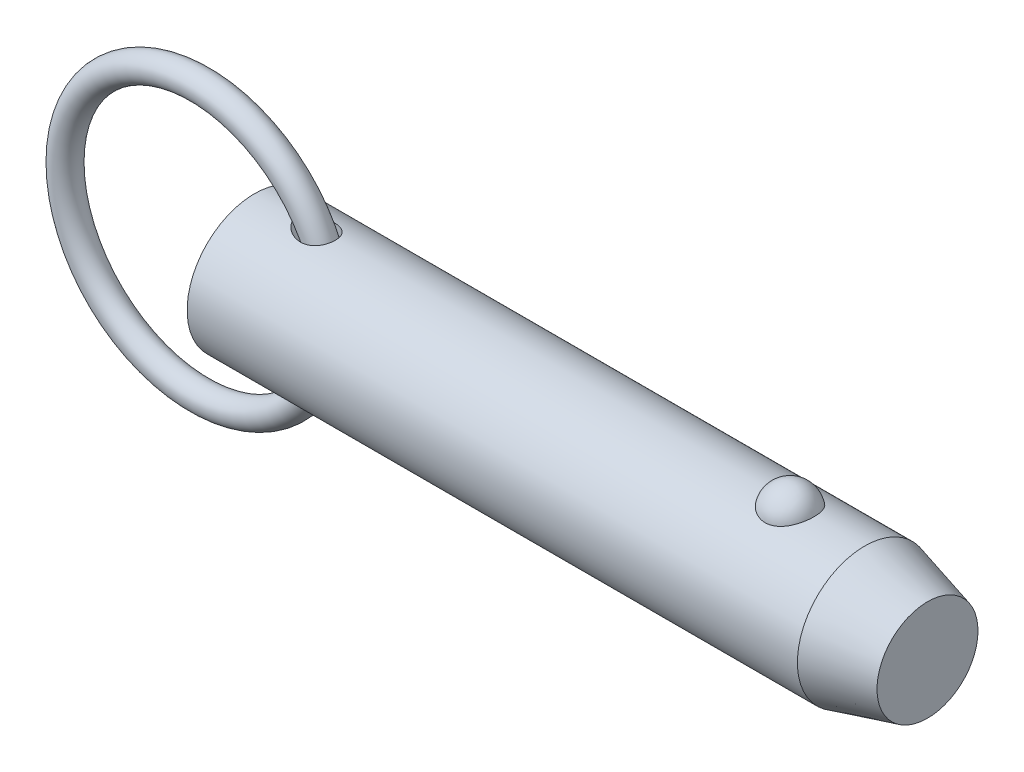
ISO-10303-21;
HEADER;
FILE_DESCRIPTION(('STEP AP214'),'2;1');
FILE_NAME('part.step','',(''),(''),'','','');
FILE_SCHEMA(('AUTOMOTIVE_DESIGN { 1 0 10303 214 1 1 1 1 }'));
ENDSEC;
DATA;
#1=APPLICATION_CONTEXT('core data for automotive mechanical design processes');
#2=APPLICATION_PROTOCOL_DEFINITION('international standard','automotive_design',2000,#1);
#3=PRODUCT_CONTEXT('',#1,'mechanical');
#4=PRODUCT('Part','Part','',(#3));
#5=PRODUCT_RELATED_PRODUCT_CATEGORY('part','',(#4));
#6=PRODUCT_DEFINITION_FORMATION('','',#4);
#7=PRODUCT_DEFINITION_CONTEXT('part definition',#1,'design');
#8=PRODUCT_DEFINITION('design','',#6,#7);
#9=PRODUCT_DEFINITION_SHAPE('','',#8);
#10=(LENGTH_UNIT() NAMED_UNIT(*) SI_UNIT(.MILLI.,.METRE.));
#11=(NAMED_UNIT(*) PLANE_ANGLE_UNIT() SI_UNIT($,.RADIAN.));
#12=(NAMED_UNIT(*) SI_UNIT($,.STERADIAN.) SOLID_ANGLE_UNIT());
#13=UNCERTAINTY_MEASURE_WITH_UNIT(LENGTH_MEASURE(1.E-05),#10,'distance_accuracy_value','');
#14=(GEOMETRIC_REPRESENTATION_CONTEXT(3) GLOBAL_UNCERTAINTY_ASSIGNED_CONTEXT((#13)) GLOBAL_UNIT_ASSIGNED_CONTEXT((#10,
#11,#12)) REPRESENTATION_CONTEXT('',''));
#15=CARTESIAN_POINT('',(0.,0.,0.));
#16=DIRECTION('',(0.,0.,1.));
#17=DIRECTION('',(1.,0.,0.));
#18=AXIS2_PLACEMENT_3D('',#15,#16,#17);
#19=CARTESIAN_POINT('',(-6.46799987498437,0.,0.));
#20=DIRECTION('',(0.,0.,1.));
#21=DIRECTION('',(1.,0.,0.));
#22=AXIS2_PLACEMENT_3D('',#19,#20,#21);
#23=TOROIDAL_SURFACE('',#22,15.875,1.588);
#24=CARTESIAN_POINT('',(10.9950001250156,0.,0.));
#25=VERTEX_POINT('',#24);
#26=VERTEX_LOOP('',#25);
#27=FACE_BOUND('',#26,.T.);
#28=ADVANCED_FACE('P0_F12',(#27),#23,.T.);
#29=CLOSED_SHELL('',(#28));
#30=MANIFOLD_SOLID_BREP('P0_B1',#29);
#31=CARTESIAN_POINT('',(0.,0.,0.));
#32=DIRECTION('',(1.,0.,0.));
#33=DIRECTION('',(0.,0.,-1.));
#34=AXIS2_PLACEMENT_3D('',#31,#32,#33);
#35=CYLINDRICAL_SURFACE('',#34,7.94);
#36=CARTESIAN_POINT('',(4.99454278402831,7.92831028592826,-0.430692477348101));
#37=CARTESIAN_POINT('',(5.02621962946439,7.92271974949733,-0.533554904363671));
#38=CARTESIAN_POINT('',(5.06869972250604,7.91528872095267,-0.633052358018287));
#39=CARTESIAN_POINT('',(5.17094751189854,7.89785690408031,-0.822566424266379));
#40=CARTESIAN_POINT('',(5.23077290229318,7.88784755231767,-0.912550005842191));
#41=CARTESIAN_POINT('',(5.37866013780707,7.8639674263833,-1.10117829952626));
#42=CARTESIAN_POINT('',(5.47004908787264,7.84973599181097,-1.19714712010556));
#43=CARTESIAN_POINT('',(5.66695490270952,7.82090787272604,-1.37293476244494));
#44=CARTESIAN_POINT('',(5.77247743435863,7.80631104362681,-1.45274707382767));
#45=CARTESIAN_POINT('',(5.99604254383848,7.77793596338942,-1.59776875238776));
#46=CARTESIAN_POINT('',(6.11428384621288,7.76417836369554,-1.66267404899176));
#47=CARTESIAN_POINT('',(6.35882685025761,7.73912410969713,-1.77564129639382));
#48=CARTESIAN_POINT('',(6.48513256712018,7.72782869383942,-1.82369477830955));
#49=CARTESIAN_POINT('',(6.76898453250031,7.70705630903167,-1.90977520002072));
#50=CARTESIAN_POINT('',(6.92778004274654,7.69837706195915,-1.94395681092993));
#51=CARTESIAN_POINT('',(7.24915504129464,7.6881294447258,-1.98412381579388));
#52=CARTESIAN_POINT('',(7.41173039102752,7.68655363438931,-1.99013871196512));
#53=CARTESIAN_POINT('',(7.697714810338,7.69094561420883,-1.97306069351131));
#54=CARTESIAN_POINT('',(7.82153338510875,7.69526202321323,-1.95634328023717));
#55=CARTESIAN_POINT('',(8.06460511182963,7.70859273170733,-1.90314615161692));
#56=CARTESIAN_POINT('',(8.18386164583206,7.7176034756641,-1.86668139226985));
#57=CARTESIAN_POINT('',(8.41450663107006,7.73959050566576,-1.77331230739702));
#58=CARTESIAN_POINT('',(8.52585042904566,7.75258738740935,-1.71630154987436));
#59=CARTESIAN_POINT('',(8.73575290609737,7.7809705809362,-1.58263416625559));
#60=CARTESIAN_POINT('',(8.8343144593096,7.7963563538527,-1.50598196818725));
#61=CARTESIAN_POINT('',(9.00639839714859,7.8259635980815,-1.34315626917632));
#62=CARTESIAN_POINT('',(9.08139772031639,7.84016008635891,-1.25853389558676));
#63=CARTESIAN_POINT('',(9.21545590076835,7.86710959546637,-1.07729126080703));
#64=CARTESIAN_POINT('',(9.27451869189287,7.87986297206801,-0.980673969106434));
#65=CARTESIAN_POINT('',(9.37315031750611,7.90198817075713,-0.782161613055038));
#66=CARTESIAN_POINT('',(9.41336512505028,7.91146854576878,-0.68059867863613));
#67=CARTESIAN_POINT('',(9.47650914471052,7.92664976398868,-0.471967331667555));
#68=CARTESIAN_POINT('',(9.49943917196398,7.93235078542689,-0.364899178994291));
#69=CARTESIAN_POINT('',(9.52744661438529,7.93934369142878,-0.14863226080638));
#70=CARTESIAN_POINT('',(9.53257574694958,7.9406483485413,-0.0394405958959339));
#71=CARTESIAN_POINT('',(9.52501411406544,7.93874464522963,0.178286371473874));
#72=CARTESIAN_POINT('',(9.51232314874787,7.93553623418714,0.286821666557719));
#73=CARTESIAN_POINT('',(9.46937875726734,7.92494527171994,0.500278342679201));
#74=CARTESIAN_POINT('',(9.43910562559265,7.9175580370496,0.605195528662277));
#75=CARTESIAN_POINT('',(9.36168926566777,7.8994090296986,0.808294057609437));
#76=CARTESIAN_POINT('',(9.31454677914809,7.88864740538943,0.906475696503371));
#77=CARTESIAN_POINT('',(9.20464679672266,7.86494645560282,1.09319438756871));
#78=CARTESIAN_POINT('',(9.14191093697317,7.85201015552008,1.18174456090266));
#79=CARTESIAN_POINT('',(9.00249124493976,7.82536913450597,1.34692675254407));
#80=CARTESIAN_POINT('',(8.92580850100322,7.81166447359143,1.42355969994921));
#81=CARTESIAN_POINT('',(8.76033130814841,7.78490157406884,1.56333296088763));
#82=CARTESIAN_POINT('',(8.67148512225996,7.77184644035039,1.62641250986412));
#83=CARTESIAN_POINT('',(8.48457694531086,7.74778101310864,1.73744892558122));
#84=CARTESIAN_POINT('',(8.3865141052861,7.73677090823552,1.78540439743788));
#85=CARTESIAN_POINT('',(8.18013312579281,7.71742695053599,1.86728938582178));
#86=CARTESIAN_POINT('',(8.07156725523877,7.7092102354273,1.90061897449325));
#87=CARTESIAN_POINT('',(7.85050876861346,7.6966502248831,1.95085652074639));
#88=CARTESIAN_POINT('',(7.73801453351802,7.69230854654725,1.967757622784));
#89=CARTESIAN_POINT('',(7.50002163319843,7.6873799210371,1.98693391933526));
#90=CARTESIAN_POINT('',(7.37438052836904,7.68722739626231,1.98751701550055));
#91=CARTESIAN_POINT('',(7.12435864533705,7.69142268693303,1.97121025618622));
#92=CARTESIAN_POINT('',(6.99997834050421,7.6957721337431,1.9543140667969));
#93=CARTESIAN_POINT('',(6.73521978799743,7.70925573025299,1.90049277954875));
#94=CARTESIAN_POINT('',(6.59543541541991,7.71903968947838,1.86081454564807));
#95=CARTESIAN_POINT('',(6.32319848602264,7.74233460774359,1.76138158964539));
#96=CARTESIAN_POINT('',(6.19076082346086,7.75585282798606,1.7015877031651));
#97=CARTESIAN_POINT('',(5.99269110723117,7.7785835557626,1.59336057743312));
#98=CARTESIAN_POINT('',(5.92332049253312,7.78707101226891,1.55151799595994));
#99=CARTESIAN_POINT('',(5.78862576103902,7.80440479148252,1.46183267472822));
#100=CARTESIAN_POINT('',(5.72330291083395,7.81325122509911,1.41398807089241));
#101=CARTESIAN_POINT('',(5.53492618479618,7.83980388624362,1.26162857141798));
#102=CARTESIAN_POINT('',(5.41884115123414,7.85759887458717,1.14795556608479));
#103=CARTESIAN_POINT('',(5.25731156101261,7.88350844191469,0.948390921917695));
#104=CARTESIAN_POINT('',(5.20241173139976,7.89260196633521,0.87019982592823));
#105=CARTESIAN_POINT('',(5.10541071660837,7.90897737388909,0.70602680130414));
#106=CARTESIAN_POINT('',(5.06329682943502,7.91626105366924,0.620052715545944));
#107=CARTESIAN_POINT('',(4.99458837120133,7.92827352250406,0.440665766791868));
#108=CARTESIAN_POINT('',(4.96816655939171,7.93297382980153,0.347182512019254));
#109=CARTESIAN_POINT('',(4.94275291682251,7.93751024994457,0.204498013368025));
#110=CARTESIAN_POINT('',(4.93665149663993,7.9386033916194,0.156529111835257));
#111=CARTESIAN_POINT('',(4.92932198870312,7.93991739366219,0.0602142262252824));
#112=CARTESIAN_POINT('',(4.9280924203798,7.94013851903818,0.011868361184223));
#113=CARTESIAN_POINT('',(4.93104052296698,7.93960920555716,-0.103241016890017));
#114=CARTESIAN_POINT('',(4.93747289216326,7.93845361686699,-0.169956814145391));
#115=CARTESIAN_POINT('',(4.95939910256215,7.93453812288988,-0.301777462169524));
#116=CARTESIAN_POINT('',(4.97489225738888,7.9317783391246,-0.36688243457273));
#117=CARTESIAN_POINT('',(4.99454278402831,7.92831028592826,-0.430692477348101));
#118=B_SPLINE_CURVE_WITH_KNOTS('',3,(#36,#37,#38,#39,#40,#41,#42,#43,#44,#45,#46,#47,#48,#49,
#50,#51,#52,#53,#54,#55,#56,#57,#58,#59,#60,#61,#62,#63,#64,#65,#66,#67,#68,#69,#70,#71,#72,#73,
#74,#75,#76,#77,#78,#79,#80,#81,#82,#83,#84,#85,#86,#87,#88,#89,#90,#91,#92,#93,#94,#95,#96,#97,
#98,#99,#100,#101,#102,#103,#104,#105,#106,#107,#108,#109,#110,#111,#112,#113,#114,#115,#116,
#117),.UNSPECIFIED.,.T.,.F.,(4,2,2,2,2,2,2,2,2,2,2,2,2,2,2,2,2,2,2,2,2,2,2,2,2,2,2,2,2,2,2,2,2,
2,2,2,2,2,2,2,4),(0.,0.323000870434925,0.647088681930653,1.04479679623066,1.4426648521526,
1.84804279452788,2.25362416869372,2.73917777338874,3.2242226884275,3.59772765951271,
3.97095014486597,4.34613445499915,4.72123425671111,5.06140749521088,5.40149668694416,
5.72887751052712,6.05624289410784,6.38265637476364,6.70907351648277,7.03585720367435,
7.36262652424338,7.68894495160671,8.01523792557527,8.34296459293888,8.67072147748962,
9.01089033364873,9.35120108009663,9.72668268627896,10.1023004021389,10.5375309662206,
10.9736138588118,11.2176803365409,11.461822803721,11.9480055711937,12.2349837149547,
12.5216758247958,12.8114683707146,12.9563497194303,13.1011870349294,13.3015737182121,
13.5019452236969),.UNSPECIFIED.);
#119=CARTESIAN_POINT('',(4.99454278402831,7.92831028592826,-0.430692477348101));
#120=VERTEX_POINT('',#119);
#121=EDGE_CURVE('P1_E40',#120,#120,#118,.T.);
#122=ORIENTED_EDGE('',*,*,#121,.T.);
#123=EDGE_LOOP('',(#122));
#124=FACE_BOUND('',#123,.T.);
#125=CARTESIAN_POINT('',(71.9718791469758,0.,0.));
#126=DIRECTION('',(1.,0.,0.));
#127=DIRECTION('',(0.,0.,-1.));
#128=AXIS2_PLACEMENT_3D('',#125,#126,#127);
#129=CIRCLE('',#128,7.94);
#130=CARTESIAN_POINT('',(71.9718791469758,0.,-7.94));
#131=VERTEX_POINT('',#130);
#132=EDGE_CURVE('P1_E25',#131,#131,#129,.T.);
#133=ORIENTED_EDGE('',*,*,#132,.F.);
#134=EDGE_LOOP('',(#133));
#135=FACE_BOUND('',#134,.T.);
#136=CARTESIAN_POINT('',(0.,0.,0.));
#137=DIRECTION('',(1.,0.,0.));
#138=DIRECTION('',(0.,0.,-1.));
#139=AXIS2_PLACEMENT_3D('',#136,#137,#138);
#140=CIRCLE('',#139,7.94);
#141=CARTESIAN_POINT('',(0.,0.,-7.94));
#142=VERTEX_POINT('',#141);
#143=EDGE_CURVE('P1_E9',#142,#142,#140,.T.);
#144=ORIENTED_EDGE('',*,*,#143,.T.);
#145=EDGE_LOOP('',(#144));
#146=FACE_BOUND('',#145,.T.);
#147=CARTESIAN_POINT('',(63.1649074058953,7.37767842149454,2.93486986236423));
#148=CARTESIAN_POINT('',(63.0127496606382,7.3776732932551,2.93487505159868));
#149=CARTESIAN_POINT('',(62.8606329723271,7.38258419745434,2.92262454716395));
#150=CARTESIAN_POINT('',(62.5609284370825,7.40163229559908,2.87404196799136));
#151=CARTESIAN_POINT('',(62.4133394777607,7.41576720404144,2.83771585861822));
#152=CARTESIAN_POINT('',(62.1270187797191,7.4516157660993,2.74218769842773));
#153=CARTESIAN_POINT('',(61.9882745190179,7.47331841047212,2.68301886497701));
#154=CARTESIAN_POINT('',(61.7228822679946,7.52194082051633,2.54350967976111));
#155=CARTESIAN_POINT('',(61.5962366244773,7.5488615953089,2.46316523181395));
#156=CARTESIAN_POINT('',(61.3545349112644,7.60594671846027,2.2809037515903));
#157=CARTESIAN_POINT('',(61.2399065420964,7.63618114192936,2.17844211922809));
#158=CARTESIAN_POINT('',(61.0288787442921,7.69614046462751,1.95608495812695));
#159=CARTESIAN_POINT('',(60.9324826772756,7.72586526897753,1.83618622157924));
#160=CARTESIAN_POINT('',(60.7559381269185,7.78314821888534,1.57628086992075));
#161=CARTESIAN_POINT('',(60.6767072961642,7.81055035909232,1.43561546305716));
#162=CARTESIAN_POINT('',(60.5417979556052,7.85879631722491,1.14236334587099));
#163=CARTESIAN_POINT('',(60.4861216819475,7.87963951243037,0.989775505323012));
#164=CARTESIAN_POINT('',(60.3988121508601,7.91289645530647,0.674619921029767));
#165=CARTESIAN_POINT('',(60.3675309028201,7.925186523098,0.511941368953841));
#166=CARTESIAN_POINT('',(60.330975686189,7.93958930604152,0.183247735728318));
#167=CARTESIAN_POINT('',(60.3257012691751,7.94170219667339,0.017232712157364));
#168=CARTESIAN_POINT('',(60.3412311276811,7.93554931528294,-0.31267286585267));
#169=CARTESIAN_POINT('',(60.3619253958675,7.92732732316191,-0.476569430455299));
#170=CARTESIAN_POINT('',(60.4287865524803,7.90141534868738,-0.79830524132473));
#171=CARTESIAN_POINT('',(60.4749539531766,7.88372517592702,-0.956144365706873));
#172=CARTESIAN_POINT('',(60.5918986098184,7.84066230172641,-1.26152073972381));
#173=CARTESIAN_POINT('',(60.6627046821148,7.81528060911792,-1.40904568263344));
#174=CARTESIAN_POINT('',(60.8274789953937,7.7594867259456,-1.68950598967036));
#175=CARTESIAN_POINT('',(60.9214488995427,7.72907417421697,-1.82244030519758));
#176=CARTESIAN_POINT('',(61.1308391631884,7.66640424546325,-2.07032792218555));
#177=CARTESIAN_POINT('',(61.2463152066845,7.63414223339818,-2.1852330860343));
#178=CARTESIAN_POINT('',(61.4959006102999,7.57149681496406,-2.39329737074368));
#179=CARTESIAN_POINT('',(61.6300080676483,7.54111321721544,-2.48645870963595));
#180=CARTESIAN_POINT('',(61.9101113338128,7.48650742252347,-2.64628132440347));
#181=CARTESIAN_POINT('',(62.0557605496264,7.46215900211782,-2.71350554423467));
#182=CARTESIAN_POINT('',(62.3574259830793,7.42171253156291,-2.82226614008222));
#183=CARTESIAN_POINT('',(62.5134383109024,7.40561140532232,-2.86381209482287));
#184=CARTESIAN_POINT('',(62.8229708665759,7.3842679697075,-2.9183907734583));
#185=CARTESIAN_POINT('',(62.9762229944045,7.37852109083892,-2.93275024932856));
#186=CARTESIAN_POINT('',(63.2830705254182,7.37700973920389,-2.93655208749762));
#187=CARTESIAN_POINT('',(63.4366658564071,7.38124333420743,-2.92599927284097));
#188=CARTESIAN_POINT('',(63.7349907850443,7.39890635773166,-2.88102897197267));
#189=CARTESIAN_POINT('',(63.8798480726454,7.41205491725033,-2.8473399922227));
#190=CARTESIAN_POINT('',(64.1616432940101,7.445801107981,-2.7578820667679));
#191=CARTESIAN_POINT('',(64.2985805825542,7.46639934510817,-2.70211132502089));
#192=CARTESIAN_POINT('',(64.5640619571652,7.51339098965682,-2.56858908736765));
#193=CARTESIAN_POINT('',(64.6923548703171,7.53990200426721,-2.4903806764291));
#194=CARTESIAN_POINT('',(64.9342440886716,7.59569503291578,-2.31462737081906));
#195=CARTESIAN_POINT('',(65.0478370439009,7.62497767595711,-2.21707808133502));
#196=CARTESIAN_POINT('',(65.26322156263,7.68489473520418,-1.99982049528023));
#197=CARTESIAN_POINT('',(65.3641488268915,7.71552419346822,-1.87925337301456));
#198=CARTESIAN_POINT('',(65.5451866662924,7.77353016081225,-1.62268826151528));
#199=CARTESIAN_POINT('',(65.6252934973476,7.80090608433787,-1.4866875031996));
#200=CARTESIAN_POINT('',(65.7653615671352,7.85047992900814,-1.19818413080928));
#201=CARTESIAN_POINT('',(65.8245877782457,7.8724818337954,-1.04529016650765));
#202=CARTESIAN_POINT('',(65.9179821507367,7.90785114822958,-0.731080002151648));
#203=CARTESIAN_POINT('',(65.9521497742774,7.92121837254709,-0.569763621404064));
#204=CARTESIAN_POINT('',(65.994795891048,7.93797834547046,-0.242812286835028));
#205=CARTESIAN_POINT('',(66.0032047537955,7.94134405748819,-0.0771668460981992));
#206=CARTESIAN_POINT('',(65.9939626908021,7.93767937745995,0.2532769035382));
#207=CARTESIAN_POINT('',(65.9763120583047,7.93064910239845,0.41807522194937));
#208=CARTESIAN_POINT('',(65.9154247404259,7.90695571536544,0.741525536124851));
#209=CARTESIAN_POINT('',(65.8722819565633,7.8903279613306,0.900197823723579));
#210=CARTESIAN_POINT('',(65.7613535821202,7.84916386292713,1.20759654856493));
#211=CARTESIAN_POINT('',(65.69356656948,7.82462706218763,1.35632241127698));
#212=CARTESIAN_POINT('',(65.5343718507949,7.7700669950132,1.64032869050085));
#213=CARTESIAN_POINT('',(65.4428616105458,7.7400200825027,1.77554712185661));
#214=CARTESIAN_POINT('',(65.2382960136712,7.67774175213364,2.02800648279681));
#215=CARTESIAN_POINT('',(65.1252410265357,7.64551037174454,2.14524772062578));
#216=CARTESIAN_POINT('',(64.8808318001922,7.58265895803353,2.35778002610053));
#217=CARTESIAN_POINT('',(64.7495833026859,7.5520309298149,2.45319004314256));
#218=CARTESIAN_POINT('',(64.471601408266,7.49579792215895,2.61999897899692));
#219=CARTESIAN_POINT('',(64.3248670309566,7.47019326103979,2.69139637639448));
#220=CARTESIAN_POINT('',(64.0129477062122,7.42622216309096,2.8105324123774));
#221=CARTESIAN_POINT('',(63.8472209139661,7.40825002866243,2.85700910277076));
#222=CARTESIAN_POINT('',(63.5092792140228,7.38398348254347,2.9191685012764));
#223=CARTESIAN_POINT('',(63.3370670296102,7.3776842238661,2.93486399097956));
#224=CARTESIAN_POINT('',(63.1649074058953,7.37767842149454,2.93486986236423));
#225=B_SPLINE_CURVE_WITH_KNOTS('',3,(#147,#148,#149,#150,#151,#152,#153,#154,#155,#156,#157,
#158,#159,#160,#161,#162,#163,#164,#165,#166,#167,#168,#169,#170,#171,#172,#173,#174,#175,#176,
#177,#178,#179,#180,#181,#182,#183,#184,#185,#186,#187,#188,#189,#190,#191,#192,#193,#194,#195,
#196,#197,#198,#199,#200,#201,#202,#203,#204,#205,#206,#207,#208,#209,#210,#211,#212,#213,#214,
#215,#216,#217,#218,#219,#220,#221,#222,#223,#224),.UNSPECIFIED.,.T.,.F.,(4,2,2,2,2,2,2,2,2,2,2,
2,2,2,2,2,2,2,2,2,2,2,2,2,2,2,2,2,2,2,2,2,2,2,2,2,2,2,4),(0.,0.455841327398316,
0.911569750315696,1.36663794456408,1.82179423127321,2.28978983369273,2.7578716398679,
3.246853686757,3.73588214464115,4.23184282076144,4.72779494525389,5.22165321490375,
5.71552141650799,6.20996917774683,6.70445245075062,7.20023431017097,7.69596557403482,
8.18023418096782,8.66432203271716,9.12410697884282,9.58380291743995,10.0296503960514,
10.4755341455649,10.9312349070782,11.3870393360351,11.8654416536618,12.3439299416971,
12.8378875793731,13.3318558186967,13.8271581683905,14.3224549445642,14.8159385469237,
15.3094506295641,15.8051323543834,16.3008055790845,16.7937101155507,17.2866458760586,
17.8026240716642,18.3183879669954),.UNSPECIFIED.);
#226=CARTESIAN_POINT('',(63.1649074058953,7.37767842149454,2.93486986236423));
#227=VERTEX_POINT('',#226);
#228=EDGE_CURVE('P1_E34',#227,#227,#225,.T.);
#229=ORIENTED_EDGE('',*,*,#228,.T.);
#230=EDGE_LOOP('',(#229));
#231=FACE_BOUND('',#230,.T.);
#232=CARTESIAN_POINT('',(4.99454278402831,-7.92831028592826,-0.430692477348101));
#233=CARTESIAN_POINT('',(4.97033227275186,-7.93258231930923,-0.352006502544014));
#234=CARTESIAN_POINT('',(4.95238785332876,-7.93578782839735,-0.271213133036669));
#235=CARTESIAN_POINT('',(4.93055628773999,-7.93969351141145,-0.107590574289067));
#236=CARTESIAN_POINT('',(4.92668686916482,-7.9403905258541,-0.0247589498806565));
#237=CARTESIAN_POINT('',(4.93338086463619,-7.93918950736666,0.140249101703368));
#238=CARTESIAN_POINT('',(4.94393526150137,-7.93729309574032,0.222425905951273));
#239=CARTESIAN_POINT('',(4.97854187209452,-7.93113325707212,0.383746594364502));
#240=CARTESIAN_POINT('',(5.00259804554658,-7.92686913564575,0.462889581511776));
#241=CARTESIAN_POINT('',(5.06904511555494,-7.91526143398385,0.633278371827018));
#242=CARTESIAN_POINT('',(5.11430124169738,-7.90744739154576,0.723368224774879));
#243=CARTESIAN_POINT('',(5.21873327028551,-7.88988375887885,0.894880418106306));
#244=CARTESIAN_POINT('',(5.27793532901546,-7.88013053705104,0.976286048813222));
#245=CARTESIAN_POINT('',(5.42949971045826,-7.85602233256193,1.15646341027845));
#246=CARTESIAN_POINT('',(5.52624420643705,-7.84124381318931,1.25147911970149));
#247=CARTESIAN_POINT('',(5.73364751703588,-7.81163164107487,1.42469165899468));
#248=CARTESIAN_POINT('',(5.84432059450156,-7.79679794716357,1.50287102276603));
#249=CARTESIAN_POINT('',(6.07871104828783,-7.76824211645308,1.64418004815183));
#250=CARTESIAN_POINT('',(6.20267992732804,-7.75455572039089,1.70689813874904));
#251=CARTESIAN_POINT('',(6.45850163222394,-7.73013259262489,1.81429879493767));
#252=CARTESIAN_POINT('',(6.5903577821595,-7.71939711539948,1.85897369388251));
#253=CARTESIAN_POINT('',(6.88209177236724,-7.70072462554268,1.93500734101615));
#254=CARTESIAN_POINT('',(7.04295460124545,-7.69356120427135,1.96286607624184));
#255=CARTESIAN_POINT('',(7.36724421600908,-7.68676336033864,1.98935053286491));
#256=CARTESIAN_POINT('',(7.53066723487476,-7.68711875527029,1.98801578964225));
#257=CARTESIAN_POINT('',(7.81370255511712,-7.69496475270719,1.95735673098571));
#258=CARTESIAN_POINT('',(7.93413357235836,-7.70066491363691,1.93505220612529));
#259=CARTESIAN_POINT('',(8.1695059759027,-7.71642704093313,1.87121573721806));
#260=CARTESIAN_POINT('',(8.28445128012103,-7.72648584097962,1.82969774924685));
#261=CARTESIAN_POINT('',(8.50557964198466,-7.75006886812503,1.72707806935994));
#262=CARTESIAN_POINT('',(8.61171927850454,-7.76360905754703,1.66588583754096));
#263=CARTESIAN_POINT('',(8.810712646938,-7.79249659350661,1.52503518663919));
#264=CARTESIAN_POINT('',(8.9035682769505,-7.80784368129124,1.44537941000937));
#265=CARTESIAN_POINT('',(9.06550151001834,-7.83702302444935,1.27723027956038));
#266=CARTESIAN_POINT('',(9.13591399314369,-7.85087516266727,1.19002179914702));
#267=CARTESIAN_POINT('',(9.26060432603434,-7.87675706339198,1.00451336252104));
#268=CARTESIAN_POINT('',(9.31488561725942,-7.88878721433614,0.906215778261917));
#269=CARTESIAN_POINT('',(9.40446618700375,-7.90930761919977,0.70456335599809));
#270=CARTESIAN_POINT('',(9.44028687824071,-7.91789338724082,0.601449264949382));
#271=CARTESIAN_POINT('',(9.49451523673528,-7.93109531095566,0.390496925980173));
#272=CARTESIAN_POINT('',(9.5129234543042,-7.93571159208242,0.282658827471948));
#273=CARTESIAN_POINT('',(9.53189686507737,-7.94047189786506,0.0654759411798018));
#274=CARTESIAN_POINT('',(9.53248611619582,-7.94062195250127,-0.0438666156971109));
#275=CARTESIAN_POINT('',(9.51587068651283,-7.93644929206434,-0.26110665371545));
#276=CARTESIAN_POINT('',(9.49866585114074,-7.93212653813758,-0.369004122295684));
#277=CARTESIAN_POINT('',(9.44682594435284,-7.91946859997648,-0.58038072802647));
#278=CARTESIAN_POINT('',(9.41217614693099,-7.91113002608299,-0.683856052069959));
#279=CARTESIAN_POINT('',(9.32626198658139,-7.89134774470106,-0.883337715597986));
#280=CARTESIAN_POINT('',(9.27499851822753,-7.87990420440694,-0.979344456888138));
#281=CARTESIAN_POINT('',(9.15725058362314,-7.8551872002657,-1.1610523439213));
#282=CARTESIAN_POINT('',(9.09078836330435,-7.84191642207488,-1.24676827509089));
#283=CARTESIAN_POINT('',(8.94443523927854,-7.81498501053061,-1.40574704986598));
#284=CARTESIAN_POINT('',(8.86454527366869,-7.80132440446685,-1.47901076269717));
#285=CARTESIAN_POINT('',(8.69307774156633,-7.77497848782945,-1.61181253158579));
#286=CARTESIAN_POINT('',(8.60142539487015,-7.76230033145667,-1.67125525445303));
#287=CARTESIAN_POINT('',(8.40957687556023,-7.73928987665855,-1.77477159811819));
#288=CARTESIAN_POINT('',(8.30937953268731,-7.72895790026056,-1.81884310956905));
#289=CARTESIAN_POINT('',(8.0986350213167,-7.71113842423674,-1.89300673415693));
#290=CARTESIAN_POINT('',(7.98782526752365,-7.70379913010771,-1.92238394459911));
#291=CARTESIAN_POINT('',(7.76294389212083,-7.69313871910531,-1.96460780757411));
#292=CARTESIAN_POINT('',(7.64887102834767,-7.68981915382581,-1.9774480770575));
#293=CARTESIAN_POINT('',(7.40716929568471,-7.68706358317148,-1.98813881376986));
#294=CARTESIAN_POINT('',(7.27945620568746,-7.68810537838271,-1.98414471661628));
#295=CARTESIAN_POINT('',(7.0259394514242,-7.6946815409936,-1.95847707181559));
#296=CARTESIAN_POINT('',(6.90013720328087,-7.7002190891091,-1.93679100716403));
#297=CARTESIAN_POINT('',(6.63265145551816,-7.71617635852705,-1.87230070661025));
#298=CARTESIAN_POINT('',(6.49169161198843,-7.72724102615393,-1.82664736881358));
#299=CARTESIAN_POINT('',(6.21840602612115,-7.75282261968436,-1.71482542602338));
#300=CARTESIAN_POINT('',(6.08608498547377,-7.76734140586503,-1.64864576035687));
#301=CARTESIAN_POINT('',(5.84453114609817,-7.7967744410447,-1.50297952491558));
#302=CARTESIAN_POINT('',(5.73429128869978,-7.81154606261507,-1.4251373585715));
#303=CARTESIAN_POINT('',(5.52761180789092,-7.84104229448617,-1.25271210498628));
#304=CARTESIAN_POINT('',(5.4311600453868,-7.85576693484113,-1.15814390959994));
#305=CARTESIAN_POINT('',(5.27970568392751,-7.87984260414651,-0.978603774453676));
#306=CARTESIAN_POINT('',(5.22040249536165,-7.88960721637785,-0.897319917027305));
#307=CARTESIAN_POINT('',(5.11583115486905,-7.90718602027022,-0.726171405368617));
#308=CARTESIAN_POINT('',(5.07050564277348,-7.9150081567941,-0.636343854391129));
#309=CARTESIAN_POINT('',(5.01937588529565,-7.92393751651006,-0.506165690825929));
#310=CARTESIAN_POINT('',(5.00622932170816,-7.926248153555,-0.468674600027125));
#311=CARTESIAN_POINT('',(4.99454278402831,-7.92831028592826,-0.430692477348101));
#312=B_SPLINE_CURVE_WITH_KNOTS('',3,(#232,#233,#234,#235,#236,#237,#238,#239,#240,#241,#242,
#243,#244,#245,#246,#247,#248,#249,#250,#251,#252,#253,#254,#255,#256,#257,#258,#259,#260,#261,
#262,#263,#264,#265,#266,#267,#268,#269,#270,#271,#272,#273,#274,#275,#276,#277,#278,#279,#280,
#281,#282,#283,#284,#285,#286,#287,#288,#289,#290,#291,#292,#293,#294,#295,#296,#297,#298,#299,
#300,#301,#302,#303,#304,#305,#306,#307,#308,#309,#310,#311),.UNSPECIFIED.,.T.,.F.,(4,2,2,2,2,2,
2,2,2,2,2,2,2,2,2,2,2,2,2,2,2,2,2,2,2,2,2,2,2,2,2,2,2,2,2,2,2,2,2,4),(0.,0.247186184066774,
0.494683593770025,0.742026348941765,0.989441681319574,1.29115800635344,1.59344478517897,
2.00047108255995,2.40791761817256,2.82525860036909,3.2427767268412,3.7304673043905,
4.21749746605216,4.58380730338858,4.94985148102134,5.31760488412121,5.68530568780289,
6.02244390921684,6.35951015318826,6.68644714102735,7.01337379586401,7.33985903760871,
7.66634711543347,7.9931112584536,8.31985780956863,8.64612913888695,8.97237768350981,
9.30081392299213,9.62929521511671,9.9724956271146,10.3158284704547,10.6977037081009,
11.0798493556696,11.523823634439,11.9680375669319,12.3738595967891,12.7793221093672,
13.0815405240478,13.3825016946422,13.5018197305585),.UNSPECIFIED.);
#313=CARTESIAN_POINT('',(4.99454278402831,-7.92831028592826,-0.430692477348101));
#314=VERTEX_POINT('',#313);
#315=EDGE_CURVE('P1_E17',#314,#314,#312,.T.);
#316=ORIENTED_EDGE('',*,*,#315,.T.);
#317=EDGE_LOOP('',(#316));
#318=FACE_BOUND('',#317,.T.);
#319=ADVANCED_FACE('P1_F13',(#124,#135,#146,#231,#318),#35,.T.);
#320=CARTESIAN_POINT('',(0.,0.,0.));
#321=DIRECTION('',(-1.,0.,0.));
#322=DIRECTION('',(0.,0.,1.));
#323=AXIS2_PLACEMENT_3D('',#320,#321,#322);
#324=PLANE('',#323);
#325=ORIENTED_EDGE('',*,*,#143,.F.);
#326=EDGE_LOOP('',(#325));
#327=FACE_BOUND('',#326,.T.);
#328=ADVANCED_FACE('P1_F15',(#327),#324,.T.);
#329=CARTESIAN_POINT('',(79.38,0.,0.));
#330=DIRECTION('',(-1.,0.,0.));
#331=DIRECTION('',(0.,0.,1.));
#332=AXIS2_PLACEMENT_3D('',#329,#330,#331);
#333=CONICAL_SURFACE('',#332,5.95500000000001,0.26179938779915);
#334=ORIENTED_EDGE('',*,*,#132,.T.);
#335=EDGE_LOOP('',(#334));
#336=FACE_BOUND('',#335,.T.);
#337=CARTESIAN_POINT('',(79.38,0.,0.));
#338=DIRECTION('',(1.,0.,0.));
#339=DIRECTION('',(0.,0.,-1.));
#340=AXIS2_PLACEMENT_3D('',#337,#338,#339);
#341=CIRCLE('',#340,5.95500000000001);
#342=CARTESIAN_POINT('',(79.38,0.,-5.95500000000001));
#343=VERTEX_POINT('',#342);
#344=EDGE_CURVE('P1_E30',#343,#343,#341,.T.);
#345=ORIENTED_EDGE('',*,*,#344,.F.);
#346=EDGE_LOOP('',(#345));
#347=FACE_BOUND('',#346,.T.);
#348=ADVANCED_FACE('P1_F55',(#336,#347),#333,.T.);
#349=CARTESIAN_POINT('',(79.38,5.95500000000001,0.));
#350=DIRECTION('',(1.,0.,0.));
#351=DIRECTION('',(0.,0.,-1.));
#352=AXIS2_PLACEMENT_3D('',#349,#350,#351);
#353=PLANE('',#352);
#354=ORIENTED_EDGE('',*,*,#344,.T.);
#355=EDGE_LOOP('',(#354));
#356=FACE_BOUND('',#355,.T.);
#357=ADVANCED_FACE('P1_F51',(#356),#353,.T.);
#358=CARTESIAN_POINT('',(63.1649074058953,7.146,0.));
#359=DIRECTION('',(-1.,0.,0.));
#360=DIRECTION('',(0.,-1.,0.));
#361=AXIS2_PLACEMENT_3D('',#358,#359,#360);
#362=SPHERICAL_SURFACE('',#361,2.944);
#363=ORIENTED_EDGE('',*,*,#228,.F.);
#364=EDGE_LOOP('',(#363));
#365=FACE_BOUND('',#364,.T.);
#366=ADVANCED_FACE('P1_F46',(#365),#362,.T.);
#367=CARTESIAN_POINT('',(-6.46799987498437,0.,0.));
#368=DIRECTION('',(0.,0.,1.));
#369=DIRECTION('',(1.,0.,0.));
#370=AXIS2_PLACEMENT_3D('',#367,#368,#369);
#371=TOROIDAL_SURFACE('',#370,15.875,1.985);
#372=ORIENTED_EDGE('',*,*,#315,.F.);
#373=EDGE_LOOP('',(#372));
#374=FACE_BOUND('',#373,.T.);
#375=ORIENTED_EDGE('',*,*,#121,.F.);
#376=EDGE_LOOP('',(#375));
#377=FACE_BOUND('',#376,.T.);
#378=ADVANCED_FACE('P1_F50',(#374,#377),#371,.F.);
#379=CLOSED_SHELL('',(#319,#328,#348,#357,#366,#378));
#380=MANIFOLD_SOLID_BREP('P1_B1',#379);
#381=ADVANCED_BREP_SHAPE_REPRESENTATION('',(#18,#30,#380),#14);
#382=SHAPE_DEFINITION_REPRESENTATION(#9,#381);
ENDSEC;
END-ISO-10303-21;
